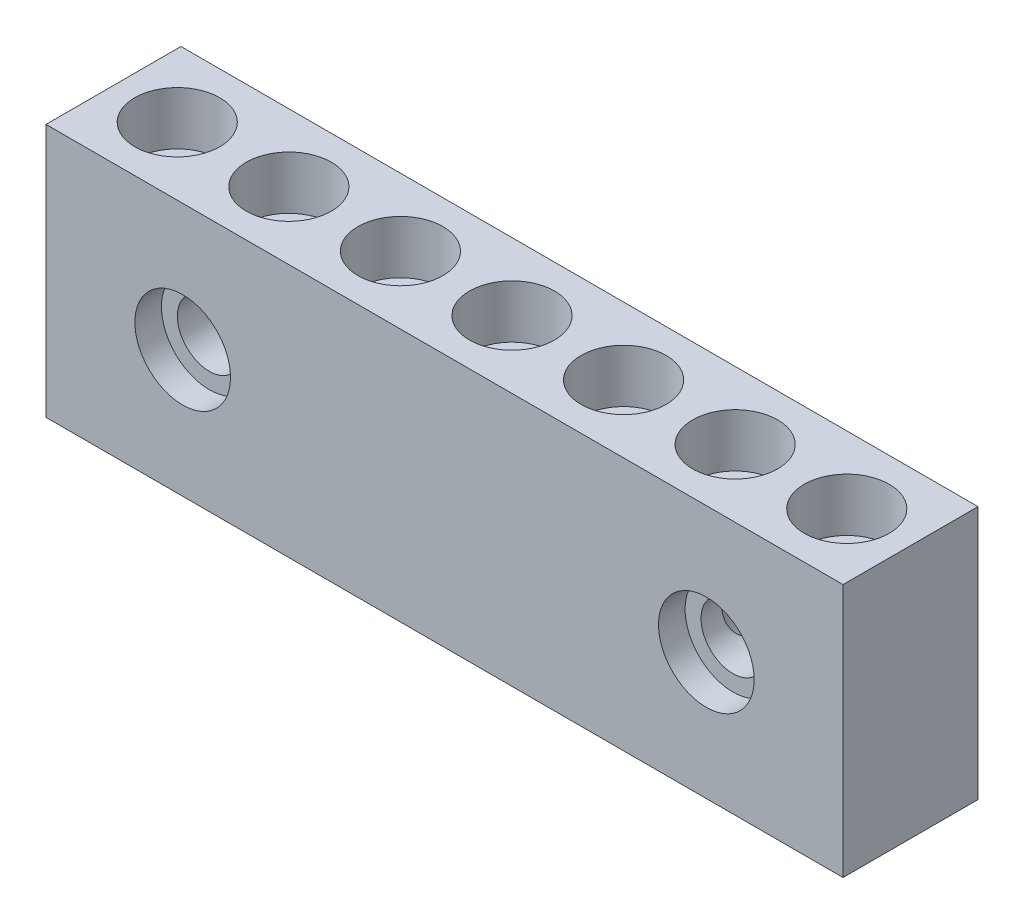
from build123d import *

# Parameters (mm, degrees)
SKETCH1_W           = 150
SKETCH1_H           = 47.75
BOSS_EXTRUDE1_DEPTH = 12.7
SKETCH4_R           = 9
CUT_EXTRUDE2_DEPTH  = 5
SKETCH5_R           = 6
CUT_EXTRUDE3_DEPTH  = 20.4
SKETCH6_R           = 8
CUT_EXTRUDE4_DEPTH  = 10
SKETCH7_R           = 4
CUT_EXTRUDE5_DEPTH  = 37.75
LPATTERN1_COUNT     = 7
LPATTERN1_PITCH     = 21


with BuildPart() as part:
    # Sketch1 → Boss-Extrude1 (new, symmetric)
    with BuildSketch(Plane.XY):
        Rectangle(SKETCH1_W, SKETCH1_H)
    extrude(amount=BOSS_EXTRUDE1_DEPTH, both=True)

    # Sketch4 → Cut-Extrude2 (cut)
    with BuildSketch(Plane.XY.offset(12.7)):
        with Locations((-49.275, -0.005)):
            Circle(SKETCH4_R)
        with Locations((49.275, -0.005)):
            Circle(SKETCH4_R)
    extrude(amount=-CUT_EXTRUDE2_DEPTH, mode=Mode.SUBTRACT)

    # Sketch5 → Cut-Extrude3 (cut)
    with BuildSketch(Plane.XY.offset(7.7)):
        with Locations((-49.275, -0.005)):
            Circle(SKETCH5_R)
        with Locations((49.275, -0.005)):
            Circle(SKETCH5_R)
    extrude(amount=-CUT_EXTRUDE3_DEPTH, mode=Mode.SUBTRACT)

    # Sketch6 → Cut-Extrude4 (cut)
    with BuildSketch(Plane(origin=(0, 23.875, 0), x_dir=(1, 0, 0), z_dir=(0, 1, 0))):
        with Locations(Location((-63, 0, 0), (0, 0, 180))):
            Circle(SKETCH6_R)
    cut_extrude4 = extrude(amount=-CUT_EXTRUDE4_DEPTH, mode=Mode.SUBTRACT)

    # Sketch7 → Cut-Extrude5 (cut)
    with BuildSketch(Plane(origin=(0, 13.875, 0), x_dir=(1, 0, 0), z_dir=(0, 1, 0))):
        with Locations(Location((-63, 0, 0), (0, 0, 180))):
            Circle(SKETCH7_R)
    cut_extrude5 = extrude(amount=-CUT_EXTRUDE5_DEPTH, mode=Mode.SUBTRACT)

    # LPattern1: Cut-Extrude4, Cut-Extrude5 ×7
    with Locations(*[(i * LPATTERN1_PITCH, 0, 0) for i in range(1, LPATTERN1_COUNT)]):
        add(cut_extrude4, mode=Mode.SUBTRACT)
        add(cut_extrude5, mode=Mode.SUBTRACT)


solid = part.part
